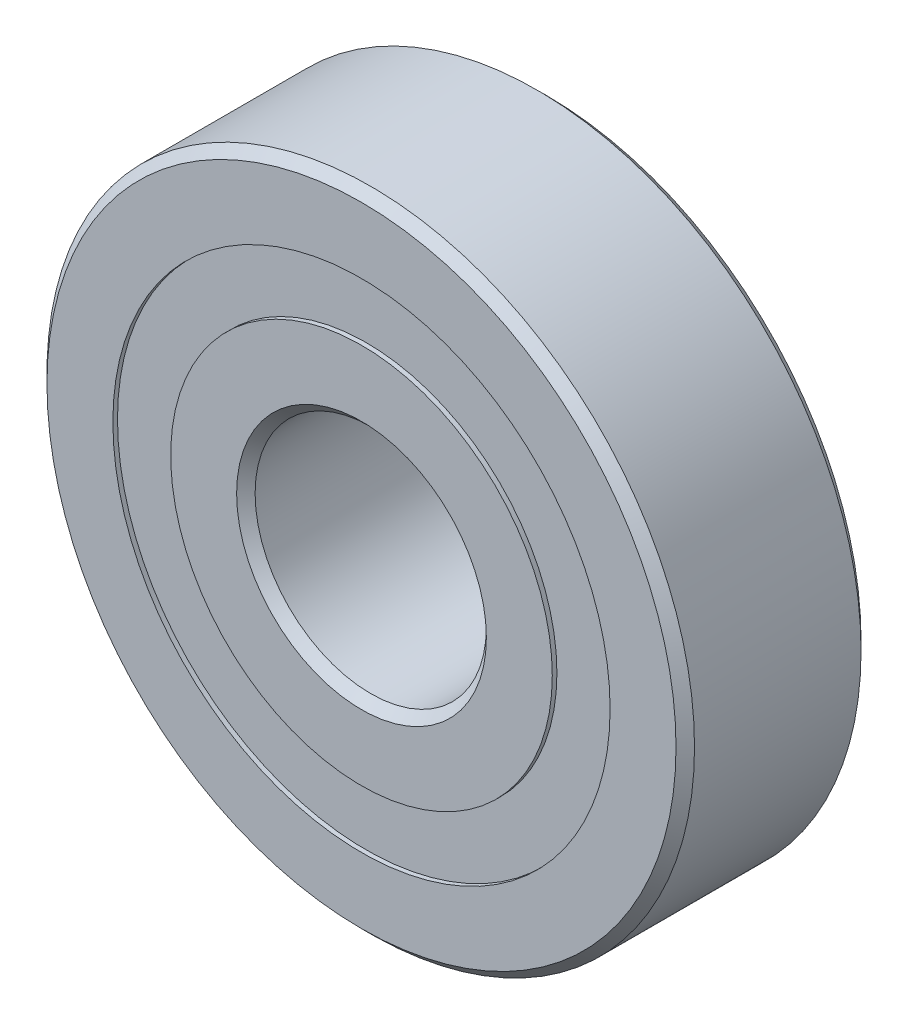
ISO-10303-21;
HEADER;
FILE_DESCRIPTION(('STEP AP214'),'2;1');
FILE_NAME('part.step','',(''),(''),'','','');
FILE_SCHEMA(('AUTOMOTIVE_DESIGN { 1 0 10303 214 1 1 1 1 }'));
ENDSEC;
DATA;
#1=APPLICATION_CONTEXT('core data for automotive mechanical design processes');
#2=APPLICATION_PROTOCOL_DEFINITION('international standard','automotive_design',2000,#1);
#3=PRODUCT_CONTEXT('',#1,'mechanical');
#4=PRODUCT('Part','Part','',(#3));
#5=PRODUCT_RELATED_PRODUCT_CATEGORY('part','',(#4));
#6=PRODUCT_DEFINITION_FORMATION('','',#4);
#7=PRODUCT_DEFINITION_CONTEXT('part definition',#1,'design');
#8=PRODUCT_DEFINITION('design','',#6,#7);
#9=PRODUCT_DEFINITION_SHAPE('','',#8);
#10=(LENGTH_UNIT() NAMED_UNIT(*) SI_UNIT(.MILLI.,.METRE.));
#11=(NAMED_UNIT(*) PLANE_ANGLE_UNIT() SI_UNIT($,.RADIAN.));
#12=(NAMED_UNIT(*) SI_UNIT($,.STERADIAN.) SOLID_ANGLE_UNIT());
#13=UNCERTAINTY_MEASURE_WITH_UNIT(LENGTH_MEASURE(1.E-05),#10,'distance_accuracy_value','');
#14=(GEOMETRIC_REPRESENTATION_CONTEXT(3) GLOBAL_UNCERTAINTY_ASSIGNED_CONTEXT((#13)) GLOBAL_UNIT_ASSIGNED_CONTEXT((#10,
#11,#12)) REPRESENTATION_CONTEXT('',''));
#15=CARTESIAN_POINT('',(0.,0.,0.));
#16=DIRECTION('',(0.,0.,1.));
#17=DIRECTION('',(1.,0.,0.));
#18=AXIS2_PLACEMENT_3D('',#15,#16,#17);
#19=CARTESIAN_POINT('',(0.,10.75,-3.8));
#20=DIRECTION('',(0.,0.,1.));
#21=DIRECTION('',(1.,0.,0.));
#22=AXIS2_PLACEMENT_3D('',#19,#20,#21);
#23=PLANE('',#22);
#24=CARTESIAN_POINT('',(0.,0.,-3.8));
#25=DIRECTION('',(0.,0.,1.));
#26=DIRECTION('',(1.,0.,0.));
#27=AXIS2_PLACEMENT_3D('',#24,#25,#26);
#28=CIRCLE('',#27,10.75);
#29=CARTESIAN_POINT('',(10.75,0.,-3.8));
#30=VERTEX_POINT('',#29);
#31=EDGE_CURVE('E66',#30,#30,#28,.T.);
#32=ORIENTED_EDGE('',*,*,#31,.F.);
#33=EDGE_LOOP('',(#32));
#34=FACE_BOUND('',#33,.T.);
#35=CARTESIAN_POINT('',(0.,0.,-3.8));
#36=DIRECTION('',(0.,0.,1.));
#37=DIRECTION('',(1.,0.,0.));
#38=AXIS2_PLACEMENT_3D('',#35,#36,#37);
#39=CIRCLE('',#38,8.25);
#40=CARTESIAN_POINT('',(8.25,0.,-3.8));
#41=VERTEX_POINT('',#40);
#42=EDGE_CURVE('E11',#41,#41,#39,.T.);
#43=ORIENTED_EDGE('',*,*,#42,.T.);
#44=EDGE_LOOP('',(#43));
#45=FACE_BOUND('',#44,.T.);
#46=ADVANCED_FACE('F52',(#34,#45),#23,.F.);
#47=CARTESIAN_POINT('',(0.,0.,4.));
#48=DIRECTION('',(0.,0.,1.));
#49=DIRECTION('',(1.,0.,0.));
#50=AXIS2_PLACEMENT_3D('',#47,#48,#49);
#51=CYLINDRICAL_SURFACE('',#50,8.25);
#52=ORIENTED_EDGE('',*,*,#42,.F.);
#53=EDGE_LOOP('',(#52));
#54=FACE_BOUND('',#53,.T.);
#55=CARTESIAN_POINT('',(0.,0.,-2.17324499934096));
#56=DIRECTION('',(0.,0.,1.));
#57=DIRECTION('',(1.,0.,0.));
#58=AXIS2_PLACEMENT_3D('',#55,#56,#57);
#59=CIRCLE('',#58,8.25);
#60=CARTESIAN_POINT('',(8.25,0.,-2.17324499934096));
#61=VERTEX_POINT('',#60);
#62=EDGE_CURVE('E58',#61,#61,#59,.T.);
#63=ORIENTED_EDGE('',*,*,#62,.T.);
#64=EDGE_LOOP('',(#63));
#65=FACE_BOUND('',#64,.T.);
#66=ADVANCED_FACE('F75',(#54,#65),#51,.F.);
#67=CARTESIAN_POINT('',(0.,10.75,-2.17324499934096));
#68=DIRECTION('',(0.,0.,-1.));
#69=DIRECTION('',(-1.,0.,0.));
#70=AXIS2_PLACEMENT_3D('',#67,#68,#69);
#71=PLANE('',#70);
#72=ORIENTED_EDGE('',*,*,#62,.F.);
#73=EDGE_LOOP('',(#72));
#74=FACE_BOUND('',#73,.T.);
#75=CARTESIAN_POINT('',(0.,0.,-2.17324499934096));
#76=DIRECTION('',(0.,0.,1.));
#77=DIRECTION('',(1.,0.,0.));
#78=AXIS2_PLACEMENT_3D('',#75,#76,#77);
#79=CIRCLE('',#78,10.75);
#80=CARTESIAN_POINT('',(10.75,0.,-2.17324499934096));
#81=VERTEX_POINT('',#80);
#82=EDGE_CURVE('E62',#81,#81,#79,.T.);
#83=ORIENTED_EDGE('',*,*,#82,.T.);
#84=EDGE_LOOP('',(#83));
#85=FACE_BOUND('',#84,.T.);
#86=ADVANCED_FACE('F79',(#74,#85),#71,.F.);
#87=CARTESIAN_POINT('',(0.,0.,4.));
#88=DIRECTION('',(0.,0.,1.));
#89=DIRECTION('',(1.,0.,0.));
#90=AXIS2_PLACEMENT_3D('',#87,#88,#89);
#91=CYLINDRICAL_SURFACE('',#90,10.75);
#92=ORIENTED_EDGE('',*,*,#82,.F.);
#93=EDGE_LOOP('',(#92));
#94=FACE_BOUND('',#93,.T.);
#95=ORIENTED_EDGE('',*,*,#31,.T.);
#96=EDGE_LOOP('',(#95));
#97=FACE_BOUND('',#96,.T.);
#98=ADVANCED_FACE('F72',(#94,#97),#91,.T.);
#99=CLOSED_SHELL('',(#46,#66,#86,#98));
#100=MANIFOLD_SOLID_BREP('B2',#99);
#101=CARTESIAN_POINT('',(0.,10.75,3.8));
#102=DIRECTION('',(0.,0.,-1.));
#103=DIRECTION('',(-1.,0.,0.));
#104=AXIS2_PLACEMENT_3D('',#101,#102,#103);
#105=PLANE('',#104);
#106=CARTESIAN_POINT('',(0.,0.,3.8));
#107=DIRECTION('',(0.,0.,1.));
#108=DIRECTION('',(1.,0.,0.));
#109=AXIS2_PLACEMENT_3D('',#106,#107,#108);
#110=CIRCLE('',#109,8.25);
#111=CARTESIAN_POINT('',(8.25,0.,3.8));
#112=VERTEX_POINT('',#111);
#113=EDGE_CURVE('E51',#112,#112,#110,.T.);
#114=ORIENTED_EDGE('',*,*,#113,.F.);
#115=EDGE_LOOP('',(#114));
#116=FACE_BOUND('',#115,.T.);
#117=CARTESIAN_POINT('',(0.,0.,3.8));
#118=DIRECTION('',(0.,0.,1.));
#119=DIRECTION('',(1.,0.,0.));
#120=AXIS2_PLACEMENT_3D('',#117,#118,#119);
#121=CIRCLE('',#120,10.75);
#122=CARTESIAN_POINT('',(10.75,0.,3.8));
#123=VERTEX_POINT('',#122);
#124=EDGE_CURVE('E150',#123,#123,#121,.T.);
#125=ORIENTED_EDGE('',*,*,#124,.T.);
#126=EDGE_LOOP('',(#125));
#127=FACE_BOUND('',#126,.T.);
#128=ADVANCED_FACE('F136',(#116,#127),#105,.F.);
#129=CARTESIAN_POINT('',(0.,0.,4.));
#130=DIRECTION('',(0.,0.,1.));
#131=DIRECTION('',(1.,0.,0.));
#132=AXIS2_PLACEMENT_3D('',#129,#130,#131);
#133=CYLINDRICAL_SURFACE('',#132,8.25);
#134=CARTESIAN_POINT('',(0.,0.,2.17324499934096));
#135=DIRECTION('',(0.,0.,1.));
#136=DIRECTION('',(1.,0.,0.));
#137=AXIS2_PLACEMENT_3D('',#134,#135,#136);
#138=CIRCLE('',#137,8.25);
#139=CARTESIAN_POINT('',(8.25,0.,2.17324499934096));
#140=VERTEX_POINT('',#139);
#141=EDGE_CURVE('E142',#140,#140,#138,.T.);
#142=ORIENTED_EDGE('',*,*,#141,.F.);
#143=EDGE_LOOP('',(#142));
#144=FACE_BOUND('',#143,.T.);
#145=ORIENTED_EDGE('',*,*,#113,.T.);
#146=EDGE_LOOP('',(#145));
#147=FACE_BOUND('',#146,.T.);
#148=ADVANCED_FACE('F165',(#144,#147),#133,.F.);
#149=CARTESIAN_POINT('',(0.,10.75,2.17324499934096));
#150=DIRECTION('',(0.,0.,1.));
#151=DIRECTION('',(1.,0.,0.));
#152=AXIS2_PLACEMENT_3D('',#149,#150,#151);
#153=PLANE('',#152);
#154=CARTESIAN_POINT('',(0.,0.,2.17324499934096));
#155=DIRECTION('',(0.,0.,1.));
#156=DIRECTION('',(1.,0.,0.));
#157=AXIS2_PLACEMENT_3D('',#154,#155,#156);
#158=CIRCLE('',#157,10.75);
#159=CARTESIAN_POINT('',(10.75,0.,2.17324499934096));
#160=VERTEX_POINT('',#159);
#161=EDGE_CURVE('E146',#160,#160,#158,.T.);
#162=ORIENTED_EDGE('',*,*,#161,.F.);
#163=EDGE_LOOP('',(#162));
#164=FACE_BOUND('',#163,.T.);
#165=ORIENTED_EDGE('',*,*,#141,.T.);
#166=EDGE_LOOP('',(#165));
#167=FACE_BOUND('',#166,.T.);
#168=ADVANCED_FACE('F160',(#164,#167),#153,.F.);
#169=CARTESIAN_POINT('',(0.,0.,4.));
#170=DIRECTION('',(0.,0.,1.));
#171=DIRECTION('',(1.,0.,0.));
#172=AXIS2_PLACEMENT_3D('',#169,#170,#171);
#173=CYLINDRICAL_SURFACE('',#172,10.75);
#174=ORIENTED_EDGE('',*,*,#124,.F.);
#175=EDGE_LOOP('',(#174));
#176=FACE_BOUND('',#175,.T.);
#177=ORIENTED_EDGE('',*,*,#161,.T.);
#178=EDGE_LOOP('',(#177));
#179=FACE_BOUND('',#178,.T.);
#180=ADVANCED_FACE('F157',(#176,#179),#173,.T.);
#181=CLOSED_SHELL('',(#128,#148,#168,#180));
#182=MANIFOLD_SOLID_BREP('B6',#181);
#183=CARTESIAN_POINT('',(-5.58395989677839,7.68566144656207,0.));
#184=DIRECTION('',(0.,0.,1.));
#185=DIRECTION('',(-0.587785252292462,0.809016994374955,0.));
#186=AXIS2_PLACEMENT_3D('',#183,#184,#185);
#187=SPHERICAL_SURFACE('',#186,2.17324499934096);
#188=CARTESIAN_POINT('',(-5.58395989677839,7.68566144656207,2.17324499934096));
#189=VERTEX_POINT('',#188);
#190=VERTEX_LOOP('',#189);
#191=FACE_BOUND('',#190,.T.);
#192=ADVANCED_FACE('F220',(#191),#187,.T.);
#193=CLOSED_SHELL('',(#192));
#194=MANIFOLD_SOLID_BREP('B46',#193);
#195=CARTESIAN_POINT('',(-9.03503690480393,2.9356614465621,0.));
#196=DIRECTION('',(0.,0.,1.));
#197=DIRECTION('',(-0.95105651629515,0.309016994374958,0.));
#198=AXIS2_PLACEMENT_3D('',#195,#196,#197);
#199=SPHERICAL_SURFACE('',#198,2.17324499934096);
#200=CARTESIAN_POINT('',(-9.03503690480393,2.9356614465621,2.17324499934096));
#201=VERTEX_POINT('',#200);
#202=VERTEX_LOOP('',#201);
#203=FACE_BOUND('',#202,.T.);
#204=ADVANCED_FACE('F239',(#203),#199,.T.);
#205=CLOSED_SHELL('',(#204));
#206=MANIFOLD_SOLID_BREP('B132',#205);
#207=CARTESIAN_POINT('',(-9.03503690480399,-2.93566144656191,0.));
#208=DIRECTION('',(0.,0.,1.));
#209=DIRECTION('',(-0.951056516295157,-0.309016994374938,0.));
#210=AXIS2_PLACEMENT_3D('',#207,#208,#209);
#211=SPHERICAL_SURFACE('',#210,2.17324499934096);
#212=CARTESIAN_POINT('',(-9.03503690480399,-2.93566144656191,2.17324499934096));
#213=VERTEX_POINT('',#212);
#214=VERTEX_LOOP('',#213);
#215=FACE_BOUND('',#214,.T.);
#216=ADVANCED_FACE('F258',(#215),#211,.T.);
#217=CLOSED_SHELL('',(#216));
#218=MANIFOLD_SOLID_BREP('B216',#217);
#219=CARTESIAN_POINT('',(-5.58395989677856,-7.68566144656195,0.));
#220=DIRECTION('',(0.,0.,1.));
#221=DIRECTION('',(-0.58778525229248,-0.809016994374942,0.));
#222=AXIS2_PLACEMENT_3D('',#219,#220,#221);
#223=SPHERICAL_SURFACE('',#222,2.17324499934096);
#224=CARTESIAN_POINT('',(-5.58395989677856,-7.68566144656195,2.17324499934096));
#225=VERTEX_POINT('',#224);
#226=VERTEX_LOOP('',#225);
#227=FACE_BOUND('',#226,.T.);
#228=ADVANCED_FACE('F277',(#227),#223,.T.);
#229=CLOSED_SHELL('',(#228));
#230=MANIFOLD_SOLID_BREP('B235',#229);
#231=CARTESIAN_POINT('',(0.,-9.5,0.));
#232=DIRECTION('',(0.,0.,1.));
#233=DIRECTION('',(0.,-1.,0.));
#234=AXIS2_PLACEMENT_3D('',#231,#232,#233);
#235=SPHERICAL_SURFACE('',#234,2.17324499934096);
#236=CARTESIAN_POINT('',(0.,-9.5,2.17324499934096));
#237=VERTEX_POINT('',#236);
#238=VERTEX_LOOP('',#237);
#239=FACE_BOUND('',#238,.T.);
#240=ADVANCED_FACE('F296',(#239),#235,.T.);
#241=CLOSED_SHELL('',(#240));
#242=MANIFOLD_SOLID_BREP('B254',#241);
#243=CARTESIAN_POINT('',(5.58395989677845,-7.68566144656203,0.));
#244=DIRECTION('',(0.,0.,1.));
#245=DIRECTION('',(0.587785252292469,-0.809016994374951,0.));
#246=AXIS2_PLACEMENT_3D('',#243,#244,#245);
#247=SPHERICAL_SURFACE('',#246,2.17324499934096);
#248=CARTESIAN_POINT('',(5.58395989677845,-7.68566144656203,2.17324499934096));
#249=VERTEX_POINT('',#248);
#250=VERTEX_LOOP('',#249);
#251=FACE_BOUND('',#250,.T.);
#252=ADVANCED_FACE('F315',(#251),#247,.T.);
#253=CLOSED_SHELL('',(#252));
#254=MANIFOLD_SOLID_BREP('B273',#253);
#255=CARTESIAN_POINT('',(9.03503690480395,-2.93566144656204,0.));
#256=DIRECTION('',(0.,0.,1.));
#257=DIRECTION('',(0.951056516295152,-0.309016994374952,0.));
#258=AXIS2_PLACEMENT_3D('',#255,#256,#257);
#259=SPHERICAL_SURFACE('',#258,2.17324499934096);
#260=CARTESIAN_POINT('',(9.03503690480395,-2.93566144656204,2.17324499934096));
#261=VERTEX_POINT('',#260);
#262=VERTEX_LOOP('',#261);
#263=FACE_BOUND('',#262,.T.);
#264=ADVANCED_FACE('F334',(#263),#259,.T.);
#265=CLOSED_SHELL('',(#264));
#266=MANIFOLD_SOLID_BREP('B292',#265);
#267=CARTESIAN_POINT('',(9.03503690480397,2.93566144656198,0.));
#268=DIRECTION('',(0.,0.,1.));
#269=DIRECTION('',(0.951056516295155,0.309016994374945,0.));
#270=AXIS2_PLACEMENT_3D('',#267,#268,#269);
#271=SPHERICAL_SURFACE('',#270,2.17324499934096);
#272=CARTESIAN_POINT('',(9.03503690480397,2.93566144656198,2.17324499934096));
#273=VERTEX_POINT('',#272);
#274=VERTEX_LOOP('',#273);
#275=FACE_BOUND('',#274,.T.);
#276=ADVANCED_FACE('F353',(#275),#271,.T.);
#277=CLOSED_SHELL('',(#276));
#278=MANIFOLD_SOLID_BREP('B311',#277);
#279=CARTESIAN_POINT('',(5.58395989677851,7.68566144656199,0.));
#280=DIRECTION('',(0.,0.,1.));
#281=DIRECTION('',(0.587785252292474,0.809016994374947,0.));
#282=AXIS2_PLACEMENT_3D('',#279,#280,#281);
#283=SPHERICAL_SURFACE('',#282,2.17324499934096);
#284=CARTESIAN_POINT('',(5.58395989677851,7.68566144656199,2.17324499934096));
#285=VERTEX_POINT('',#284);
#286=VERTEX_LOOP('',#285);
#287=FACE_BOUND('',#286,.T.);
#288=ADVANCED_FACE('F372',(#287),#283,.T.);
#289=CLOSED_SHELL('',(#288));
#290=MANIFOLD_SOLID_BREP('B330',#289);
#291=CARTESIAN_POINT('',(0.,9.5,0.));
#292=DIRECTION('',(0.,0.,1.));
#293=DIRECTION('',(0.,1.,0.));
#294=AXIS2_PLACEMENT_3D('',#291,#292,#293);
#295=SPHERICAL_SURFACE('',#294,2.17324499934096);
#296=CARTESIAN_POINT('',(0.,9.5,2.17324499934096));
#297=VERTEX_POINT('',#296);
#298=VERTEX_LOOP('',#297);
#299=FACE_BOUND('',#298,.T.);
#300=ADVANCED_FACE('F393',(#299),#295,.T.);
#301=CLOSED_SHELL('',(#300));
#302=MANIFOLD_SOLID_BREP('B349',#301);
#303=CARTESIAN_POINT('',(0.,0.,4.));
#304=DIRECTION('',(0.,0.,1.));
#305=DIRECTION('',(1.,0.,0.));
#306=AXIS2_PLACEMENT_3D('',#303,#304,#305);
#307=CONICAL_SURFACE('',#306,5.4,0.785398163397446);
#308=CARTESIAN_POINT('',(0.,0.,3.6));
#309=DIRECTION('',(0.,0.,1.));
#310=DIRECTION('',(1.,0.,0.));
#311=AXIS2_PLACEMENT_3D('',#308,#309,#310);
#312=CIRCLE('',#311,5.);
#313=CARTESIAN_POINT('',(5.,0.,3.6));
#314=VERTEX_POINT('',#313);
#315=EDGE_CURVE('E392',#314,#314,#312,.T.);
#316=ORIENTED_EDGE('',*,*,#315,.F.);
#317=EDGE_LOOP('',(#316));
#318=FACE_BOUND('',#317,.T.);
#319=CARTESIAN_POINT('',(0.,0.,4.));
#320=DIRECTION('',(0.,0.,1.));
#321=DIRECTION('',(1.,0.,0.));
#322=AXIS2_PLACEMENT_3D('',#319,#320,#321);
#323=CIRCLE('',#322,5.4);
#324=CARTESIAN_POINT('',(5.4,0.,4.));
#325=VERTEX_POINT('',#324);
#326=EDGE_CURVE('E439',#325,#325,#323,.T.);
#327=ORIENTED_EDGE('',*,*,#326,.T.);
#328=EDGE_LOOP('',(#327));
#329=FACE_BOUND('',#328,.T.);
#330=ADVANCED_FACE('F411',(#318,#329),#307,.F.);
#331=CARTESIAN_POINT('',(0.,0.,4.));
#332=DIRECTION('',(0.,0.,1.));
#333=DIRECTION('',(1.,0.,0.));
#334=AXIS2_PLACEMENT_3D('',#331,#332,#333);
#335=CYLINDRICAL_SURFACE('',#334,5.);
#336=CARTESIAN_POINT('',(0.,0.,-3.6));
#337=DIRECTION('',(0.,0.,1.));
#338=DIRECTION('',(1.,0.,0.));
#339=AXIS2_PLACEMENT_3D('',#336,#337,#338);
#340=CIRCLE('',#339,5.);
#341=CARTESIAN_POINT('',(5.,0.,-3.6));
#342=VERTEX_POINT('',#341);
#343=EDGE_CURVE('E417',#342,#342,#340,.T.);
#344=ORIENTED_EDGE('',*,*,#343,.F.);
#345=EDGE_LOOP('',(#344));
#346=FACE_BOUND('',#345,.T.);
#347=ORIENTED_EDGE('',*,*,#315,.T.);
#348=EDGE_LOOP('',(#347));
#349=FACE_BOUND('',#348,.T.);
#350=ADVANCED_FACE('F476',(#346,#349),#335,.F.);
#351=CARTESIAN_POINT('',(0.,0.,-3.6));
#352=DIRECTION('',(0.,0.,-1.));
#353=DIRECTION('',(-1.,0.,0.));
#354=AXIS2_PLACEMENT_3D('',#351,#352,#353);
#355=CONICAL_SURFACE('',#354,5.,0.785398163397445);
#356=CARTESIAN_POINT('',(0.,0.,-4.));
#357=DIRECTION('',(0.,0.,1.));
#358=DIRECTION('',(1.,0.,0.));
#359=AXIS2_PLACEMENT_3D('',#356,#357,#358);
#360=CIRCLE('',#359,5.4);
#361=CARTESIAN_POINT('',(5.4,0.,-4.));
#362=VERTEX_POINT('',#361);
#363=EDGE_CURVE('E421',#362,#362,#360,.T.);
#364=ORIENTED_EDGE('',*,*,#363,.F.);
#365=EDGE_LOOP('',(#364));
#366=FACE_BOUND('',#365,.T.);
#367=ORIENTED_EDGE('',*,*,#343,.T.);
#368=EDGE_LOOP('',(#367));
#369=FACE_BOUND('',#368,.T.);
#370=ADVANCED_FACE('F471',(#366,#369),#355,.F.);
#371=CARTESIAN_POINT('',(0.,5.4,-4.));
#372=DIRECTION('',(0.,0.,1.));
#373=DIRECTION('',(1.,0.,0.));
#374=AXIS2_PLACEMENT_3D('',#371,#372,#373);
#375=PLANE('',#374);
#376=CARTESIAN_POINT('',(0.,0.,-4.));
#377=DIRECTION('',(0.,0.,1.));
#378=DIRECTION('',(1.,0.,0.));
#379=AXIS2_PLACEMENT_3D('',#376,#377,#378);
#380=CIRCLE('',#379,8.25);
#381=CARTESIAN_POINT('',(8.25,0.,-4.));
#382=VERTEX_POINT('',#381);
#383=EDGE_CURVE('E425',#382,#382,#380,.T.);
#384=ORIENTED_EDGE('',*,*,#383,.F.);
#385=EDGE_LOOP('',(#384));
#386=FACE_BOUND('',#385,.T.);
#387=ORIENTED_EDGE('',*,*,#363,.T.);
#388=EDGE_LOOP('',(#387));
#389=FACE_BOUND('',#388,.T.);
#390=ADVANCED_FACE('F465',(#386,#389),#375,.F.);
#391=CARTESIAN_POINT('',(0.,0.,4.));
#392=DIRECTION('',(0.,0.,1.));
#393=DIRECTION('',(1.,0.,0.));
#394=AXIS2_PLACEMENT_3D('',#391,#392,#393);
#395=CYLINDRICAL_SURFACE('',#394,8.25);
#396=CARTESIAN_POINT('',(0.,0.,-1.77777777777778));
#397=DIRECTION('',(0.,0.,1.));
#398=DIRECTION('',(1.,0.,0.));
#399=AXIS2_PLACEMENT_3D('',#396,#397,#398);
#400=CIRCLE('',#399,8.25);
#401=CARTESIAN_POINT('',(8.25,0.,-1.77777777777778));
#402=VERTEX_POINT('',#401);
#403=EDGE_CURVE('E430',#402,#402,#400,.T.);
#404=ORIENTED_EDGE('',*,*,#403,.F.);
#405=EDGE_LOOP('',(#404));
#406=FACE_BOUND('',#405,.T.);
#407=ORIENTED_EDGE('',*,*,#383,.T.);
#408=EDGE_LOOP('',(#407));
#409=FACE_BOUND('',#408,.T.);
#410=ADVANCED_FACE('F459',(#406,#409),#395,.T.);
#411=CARTESIAN_POINT('',(0.,0.,0.));
#412=DIRECTION('',(0.,0.,1.));
#413=DIRECTION('',(1.,0.,0.));
#414=AXIS2_PLACEMENT_3D('',#411,#412,#413);
#415=TOROIDAL_SURFACE('',#414,9.5,2.17324499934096);
#416=CARTESIAN_POINT('',(0.,0.,1.77777777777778));
#417=DIRECTION('',(0.,0.,1.));
#418=DIRECTION('',(1.,0.,0.));
#419=AXIS2_PLACEMENT_3D('',#416,#417,#418);
#420=CIRCLE('',#419,8.25);
#421=CARTESIAN_POINT('',(8.25,0.,1.77777777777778));
#422=VERTEX_POINT('',#421);
#423=EDGE_CURVE('E433',#422,#422,#420,.T.);
#424=ORIENTED_EDGE('',*,*,#423,.F.);
#425=EDGE_LOOP('',(#424));
#426=FACE_BOUND('',#425,.T.);
#427=ORIENTED_EDGE('',*,*,#403,.T.);
#428=EDGE_LOOP('',(#427));
#429=FACE_BOUND('',#428,.T.);
#430=ADVANCED_FACE('F453',(#426,#429),#415,.F.);
#431=CARTESIAN_POINT('',(0.,0.,4.));
#432=DIRECTION('',(0.,0.,1.));
#433=DIRECTION('',(1.,0.,0.));
#434=AXIS2_PLACEMENT_3D('',#431,#432,#433);
#435=CYLINDRICAL_SURFACE('',#434,8.25);
#436=CARTESIAN_POINT('',(0.,0.,4.));
#437=DIRECTION('',(0.,0.,1.));
#438=DIRECTION('',(1.,0.,0.));
#439=AXIS2_PLACEMENT_3D('',#436,#437,#438);
#440=CIRCLE('',#439,8.25);
#441=CARTESIAN_POINT('',(8.25,0.,4.));
#442=VERTEX_POINT('',#441);
#443=EDGE_CURVE('E436',#442,#442,#440,.T.);
#444=ORIENTED_EDGE('',*,*,#443,.F.);
#445=EDGE_LOOP('',(#444));
#446=FACE_BOUND('',#445,.T.);
#447=ORIENTED_EDGE('',*,*,#423,.T.);
#448=EDGE_LOOP('',(#447));
#449=FACE_BOUND('',#448,.T.);
#450=ADVANCED_FACE('F447',(#446,#449),#435,.T.);
#451=CARTESIAN_POINT('',(0.,5.4,4.));
#452=DIRECTION('',(0.,0.,-1.));
#453=DIRECTION('',(-1.,0.,0.));
#454=AXIS2_PLACEMENT_3D('',#451,#452,#453);
#455=PLANE('',#454);
#456=ORIENTED_EDGE('',*,*,#326,.F.);
#457=EDGE_LOOP('',(#456));
#458=FACE_BOUND('',#457,.T.);
#459=ORIENTED_EDGE('',*,*,#443,.T.);
#460=EDGE_LOOP('',(#459));
#461=FACE_BOUND('',#460,.T.);
#462=ADVANCED_FACE('F444',(#458,#461),#455,.F.);
#463=CLOSED_SHELL('',(#330,#350,#370,#390,#410,#430,#450,#462));
#464=MANIFOLD_SOLID_BREP('B368',#463);
#465=CARTESIAN_POINT('',(0.,0.,3.6));
#466=DIRECTION('',(0.,0.,-1.));
#467=DIRECTION('',(-1.,0.,0.));
#468=AXIS2_PLACEMENT_3D('',#465,#466,#467);
#469=CONICAL_SURFACE('',#468,14.,0.785398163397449);
#470=CARTESIAN_POINT('',(0.,0.,4.));
#471=DIRECTION('',(0.,0.,1.));
#472=DIRECTION('',(1.,0.,0.));
#473=AXIS2_PLACEMENT_3D('',#470,#471,#472);
#474=CIRCLE('',#473,13.6);
#475=CARTESIAN_POINT('',(13.6,0.,4.));
#476=VERTEX_POINT('',#475);
#477=EDGE_CURVE('E410',#476,#476,#474,.T.);
#478=ORIENTED_EDGE('',*,*,#477,.F.);
#479=EDGE_LOOP('',(#478));
#480=FACE_BOUND('',#479,.T.);
#481=CARTESIAN_POINT('',(0.,0.,3.6));
#482=DIRECTION('',(0.,0.,1.));
#483=DIRECTION('',(1.,0.,0.));
#484=AXIS2_PLACEMENT_3D('',#481,#482,#483);
#485=CIRCLE('',#484,14.);
#486=CARTESIAN_POINT('',(14.,0.,3.6));
#487=VERTEX_POINT('',#486);
#488=EDGE_CURVE('E545',#487,#487,#485,.T.);
#489=ORIENTED_EDGE('',*,*,#488,.T.);
#490=EDGE_LOOP('',(#489));
#491=FACE_BOUND('',#490,.T.);
#492=ADVANCED_FACE('F517',(#480,#491),#469,.T.);
#493=CARTESIAN_POINT('',(0.,13.6,4.));
#494=DIRECTION('',(0.,0.,-1.));
#495=DIRECTION('',(-1.,0.,0.));
#496=AXIS2_PLACEMENT_3D('',#493,#494,#495);
#497=PLANE('',#496);
#498=CARTESIAN_POINT('',(0.,0.,4.));
#499=DIRECTION('',(0.,0.,1.));
#500=DIRECTION('',(1.,0.,0.));
#501=AXIS2_PLACEMENT_3D('',#498,#499,#500);
#502=CIRCLE('',#501,10.75);
#503=CARTESIAN_POINT('',(10.75,0.,4.));
#504=VERTEX_POINT('',#503);
#505=EDGE_CURVE('E523',#504,#504,#502,.T.);
#506=ORIENTED_EDGE('',*,*,#505,.F.);
#507=EDGE_LOOP('',(#506));
#508=FACE_BOUND('',#507,.T.);
#509=ORIENTED_EDGE('',*,*,#477,.T.);
#510=EDGE_LOOP('',(#509));
#511=FACE_BOUND('',#510,.T.);
#512=ADVANCED_FACE('F582',(#508,#511),#497,.F.);
#513=CARTESIAN_POINT('',(0.,0.,4.));
#514=DIRECTION('',(0.,0.,1.));
#515=DIRECTION('',(1.,0.,0.));
#516=AXIS2_PLACEMENT_3D('',#513,#514,#515);
#517=CYLINDRICAL_SURFACE('',#516,10.75);
#518=CARTESIAN_POINT('',(0.,0.,1.77777777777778));
#519=DIRECTION('',(0.,0.,1.));
#520=DIRECTION('',(1.,0.,0.));
#521=AXIS2_PLACEMENT_3D('',#518,#519,#520);
#522=CIRCLE('',#521,10.75);
#523=CARTESIAN_POINT('',(10.75,0.,1.77777777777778));
#524=VERTEX_POINT('',#523);
#525=EDGE_CURVE('E527',#524,#524,#522,.T.);
#526=ORIENTED_EDGE('',*,*,#525,.F.);
#527=EDGE_LOOP('',(#526));
#528=FACE_BOUND('',#527,.T.);
#529=ORIENTED_EDGE('',*,*,#505,.T.);
#530=EDGE_LOOP('',(#529));
#531=FACE_BOUND('',#530,.T.);
#532=ADVANCED_FACE('F577',(#528,#531),#517,.F.);
#533=CARTESIAN_POINT('',(0.,0.,0.));
#534=DIRECTION('',(0.,0.,1.));
#535=DIRECTION('',(1.,0.,0.));
#536=AXIS2_PLACEMENT_3D('',#533,#534,#535);
#537=TOROIDAL_SURFACE('',#536,9.5,2.17324499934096);
#538=CARTESIAN_POINT('',(0.,0.,-1.77777777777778));
#539=DIRECTION('',(0.,0.,1.));
#540=DIRECTION('',(1.,0.,0.));
#541=AXIS2_PLACEMENT_3D('',#538,#539,#540);
#542=CIRCLE('',#541,10.75);
#543=CARTESIAN_POINT('',(10.75,0.,-1.77777777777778));
#544=VERTEX_POINT('',#543);
#545=EDGE_CURVE('E531',#544,#544,#542,.T.);
#546=ORIENTED_EDGE('',*,*,#545,.F.);
#547=EDGE_LOOP('',(#546));
#548=FACE_BOUND('',#547,.T.);
#549=ORIENTED_EDGE('',*,*,#525,.T.);
#550=EDGE_LOOP('',(#549));
#551=FACE_BOUND('',#550,.T.);
#552=ADVANCED_FACE('F571',(#548,#551),#537,.F.);
#553=CARTESIAN_POINT('',(0.,0.,4.));
#554=DIRECTION('',(0.,0.,1.));
#555=DIRECTION('',(1.,0.,0.));
#556=AXIS2_PLACEMENT_3D('',#553,#554,#555);
#557=CYLINDRICAL_SURFACE('',#556,10.75);
#558=CARTESIAN_POINT('',(0.,0.,-4.));
#559=DIRECTION('',(0.,0.,1.));
#560=DIRECTION('',(1.,0.,0.));
#561=AXIS2_PLACEMENT_3D('',#558,#559,#560);
#562=CIRCLE('',#561,10.75);
#563=CARTESIAN_POINT('',(10.75,0.,-4.));
#564=VERTEX_POINT('',#563);
#565=EDGE_CURVE('E536',#564,#564,#562,.T.);
#566=ORIENTED_EDGE('',*,*,#565,.F.);
#567=EDGE_LOOP('',(#566));
#568=FACE_BOUND('',#567,.T.);
#569=ORIENTED_EDGE('',*,*,#545,.T.);
#570=EDGE_LOOP('',(#569));
#571=FACE_BOUND('',#570,.T.);
#572=ADVANCED_FACE('F565',(#568,#571),#557,.F.);
#573=CARTESIAN_POINT('',(0.,13.6,-4.));
#574=DIRECTION('',(0.,0.,1.));
#575=DIRECTION('',(1.,0.,0.));
#576=AXIS2_PLACEMENT_3D('',#573,#574,#575);
#577=PLANE('',#576);
#578=CARTESIAN_POINT('',(0.,0.,-4.));
#579=DIRECTION('',(0.,0.,1.));
#580=DIRECTION('',(1.,0.,0.));
#581=AXIS2_PLACEMENT_3D('',#578,#579,#580);
#582=CIRCLE('',#581,13.6);
#583=CARTESIAN_POINT('',(13.6,0.,-4.));
#584=VERTEX_POINT('',#583);
#585=EDGE_CURVE('E539',#584,#584,#582,.T.);
#586=ORIENTED_EDGE('',*,*,#585,.F.);
#587=EDGE_LOOP('',(#586));
#588=FACE_BOUND('',#587,.T.);
#589=ORIENTED_EDGE('',*,*,#565,.T.);
#590=EDGE_LOOP('',(#589));
#591=FACE_BOUND('',#590,.T.);
#592=ADVANCED_FACE('F559',(#588,#591),#577,.F.);
#593=CARTESIAN_POINT('',(0.,0.,-4.));
#594=DIRECTION('',(0.,0.,1.));
#595=DIRECTION('',(1.,0.,0.));
#596=AXIS2_PLACEMENT_3D('',#593,#594,#595);
#597=CONICAL_SURFACE('',#596,13.6,0.785398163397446);
#598=CARTESIAN_POINT('',(0.,0.,-3.6));
#599=DIRECTION('',(0.,0.,1.));
#600=DIRECTION('',(1.,0.,0.));
#601=AXIS2_PLACEMENT_3D('',#598,#599,#600);
#602=CIRCLE('',#601,14.);
#603=CARTESIAN_POINT('',(14.,0.,-3.6));
#604=VERTEX_POINT('',#603);
#605=EDGE_CURVE('E542',#604,#604,#602,.T.);
#606=ORIENTED_EDGE('',*,*,#605,.F.);
#607=EDGE_LOOP('',(#606));
#608=FACE_BOUND('',#607,.T.);
#609=ORIENTED_EDGE('',*,*,#585,.T.);
#610=EDGE_LOOP('',(#609));
#611=FACE_BOUND('',#610,.T.);
#612=ADVANCED_FACE('F553',(#608,#611),#597,.T.);
#613=CARTESIAN_POINT('',(0.,0.,4.));
#614=DIRECTION('',(0.,0.,1.));
#615=DIRECTION('',(1.,0.,0.));
#616=AXIS2_PLACEMENT_3D('',#613,#614,#615);
#617=CYLINDRICAL_SURFACE('',#616,14.);
#618=ORIENTED_EDGE('',*,*,#488,.F.);
#619=EDGE_LOOP('',(#618));
#620=FACE_BOUND('',#619,.T.);
#621=ORIENTED_EDGE('',*,*,#605,.T.);
#622=EDGE_LOOP('',(#621));
#623=FACE_BOUND('',#622,.T.);
#624=ADVANCED_FACE('F550',(#620,#623),#617,.T.);
#625=CLOSED_SHELL('',(#492,#512,#532,#552,#572,#592,#612,#624));
#626=MANIFOLD_SOLID_BREP('B387',#625);
#627=ADVANCED_BREP_SHAPE_REPRESENTATION('',(#18,#100,#182,#194,#206,#218,#230,#242,#254,#266,
#278,#290,#302,#464,#626),#14);
#628=SHAPE_DEFINITION_REPRESENTATION(#9,#627);
ENDSEC;
END-ISO-10303-21;
